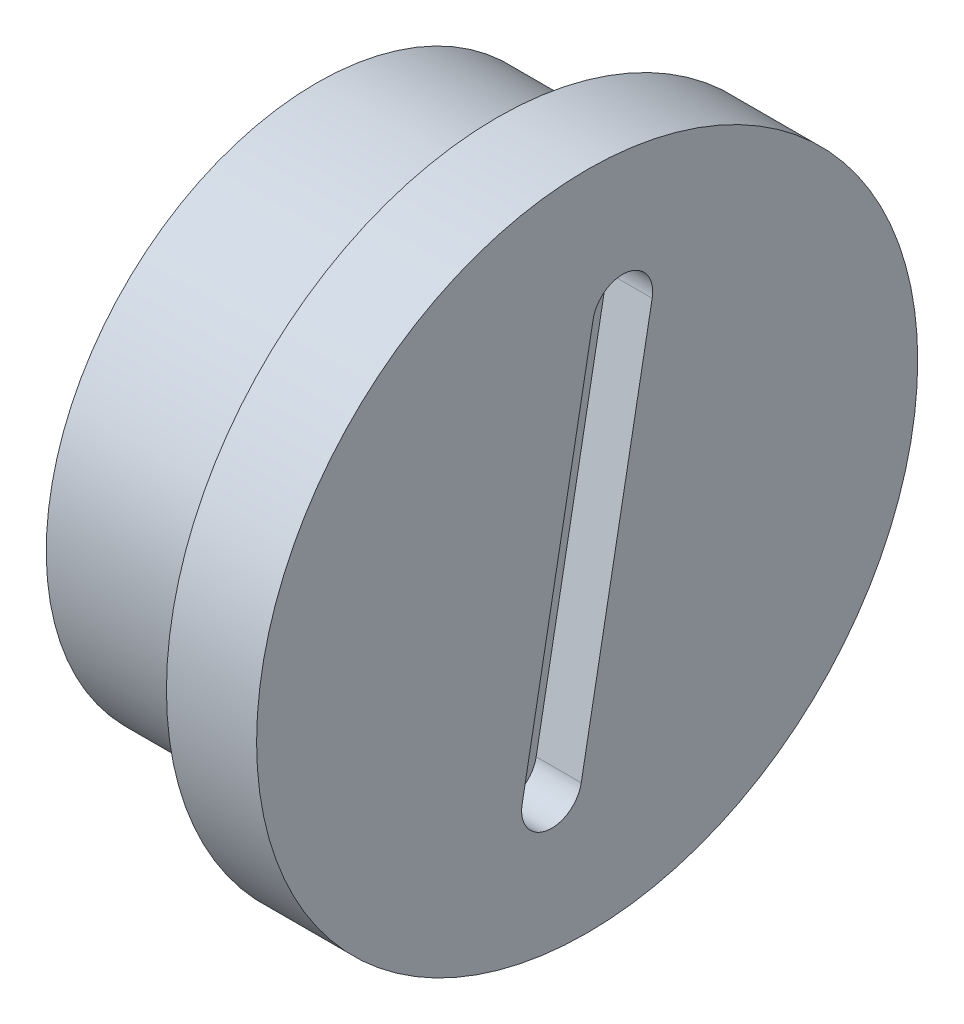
ISO-10303-21;
HEADER;
FILE_DESCRIPTION(('STEP AP214'),'2;1');
FILE_NAME('part.step','',(''),(''),'','','');
FILE_SCHEMA(('AUTOMOTIVE_DESIGN { 1 0 10303 214 1 1 1 1 }'));
ENDSEC;
DATA;
#1=APPLICATION_CONTEXT('core data for automotive mechanical design processes');
#2=APPLICATION_PROTOCOL_DEFINITION('international standard','automotive_design',2000,#1);
#3=PRODUCT_CONTEXT('',#1,'mechanical');
#4=PRODUCT('Part','Part','',(#3));
#5=PRODUCT_RELATED_PRODUCT_CATEGORY('part','',(#4));
#6=PRODUCT_DEFINITION_FORMATION('','',#4);
#7=PRODUCT_DEFINITION_CONTEXT('part definition',#1,'design');
#8=PRODUCT_DEFINITION('design','',#6,#7);
#9=PRODUCT_DEFINITION_SHAPE('','',#8);
#10=(LENGTH_UNIT() NAMED_UNIT(*) SI_UNIT(.MILLI.,.METRE.));
#11=(NAMED_UNIT(*) PLANE_ANGLE_UNIT() SI_UNIT($,.RADIAN.));
#12=(NAMED_UNIT(*) SI_UNIT($,.STERADIAN.) SOLID_ANGLE_UNIT());
#13=UNCERTAINTY_MEASURE_WITH_UNIT(LENGTH_MEASURE(1.E-05),#10,'distance_accuracy_value','');
#14=(GEOMETRIC_REPRESENTATION_CONTEXT(3) GLOBAL_UNCERTAINTY_ASSIGNED_CONTEXT((#13)) GLOBAL_UNIT_ASSIGNED_CONTEXT((#10,
#11,#12)) REPRESENTATION_CONTEXT('',''));
#15=CARTESIAN_POINT('',(0.,0.,0.));
#16=DIRECTION('',(0.,0.,1.));
#17=DIRECTION('',(1.,0.,0.));
#18=AXIS2_PLACEMENT_3D('',#15,#16,#17);
#19=CARTESIAN_POINT('',(31.5,84.,-76.5));
#20=DIRECTION('',(1.,0.,0.));
#21=DIRECTION('',(0.,1.,0.));
#22=AXIS2_PLACEMENT_3D('',#19,#20,#21);
#23=PLANE('',#22);
#24=CARTESIAN_POINT('',(31.5,84.,-76.5));
#25=DIRECTION('',(1.,0.,0.));
#26=DIRECTION('',(0.,1.,0.));
#27=AXIS2_PLACEMENT_3D('',#24,#25,#26);
#28=CIRCLE('',#27,9.);
#29=CARTESIAN_POINT('',(31.5,93.,-76.5));
#30=VERTEX_POINT('',#29);
#31=EDGE_CURVE('E20',#30,#30,#28,.T.);
#32=ORIENTED_EDGE('',*,*,#31,.F.);
#33=EDGE_LOOP('',(#32));
#34=FACE_BOUND('',#33,.T.);
#35=ADVANCED_FACE('F16',(#34),#23,.F.);
#36=CARTESIAN_POINT('',(31.5,84.,-76.5));
#37=DIRECTION('',(1.,0.,0.));
#38=DIRECTION('',(0.,1.,0.));
#39=AXIS2_PLACEMENT_3D('',#36,#37,#38);
#40=CYLINDRICAL_SURFACE('',#39,9.);
#41=CARTESIAN_POINT('',(37.5,84.,-76.5));
#42=DIRECTION('',(1.,0.,0.));
#43=DIRECTION('',(0.,1.,0.));
#44=AXIS2_PLACEMENT_3D('',#41,#42,#43);
#45=CIRCLE('',#44,9.);
#46=CARTESIAN_POINT('',(37.5,93.,-76.5));
#47=VERTEX_POINT('',#46);
#48=EDGE_CURVE('E76',#47,#47,#45,.F.);
#49=ORIENTED_EDGE('',*,*,#48,.T.);
#50=EDGE_LOOP('',(#49));
#51=FACE_BOUND('',#50,.T.);
#52=ORIENTED_EDGE('',*,*,#31,.T.);
#53=EDGE_LOOP('',(#52));
#54=FACE_BOUND('',#53,.T.);
#55=ADVANCED_FACE('F113',(#51,#54),#40,.T.);
#56=CARTESIAN_POINT('',(39.,90.3919397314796,-77.6802993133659));
#57=DIRECTION('',(-1.,0.,0.));
#58=DIRECTION('',(0.,-1.,0.));
#59=AXIS2_PLACEMENT_3D('',#56,#57,#58);
#60=PLANE('',#59);
#61=DIRECTION('',(0.,-0.983375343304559,0.181584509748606));
#62=VECTOR('',#61,1.);
#63=CARTESIAN_POINT('',(39.,77.789644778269,-74.3363253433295));
#64=LINE('',#63,#62);
#65=CARTESIAN_POINT('',(39.,90.5735242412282,-76.6969239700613));
#66=VERTEX_POINT('',#65);
#67=CARTESIAN_POINT('',(39.,77.7896447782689,-74.3363253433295));
#68=VERTEX_POINT('',#67);
#69=EDGE_CURVE('E92',#66,#68,#64,.T.);
#70=ORIENTED_EDGE('',*,*,#69,.T.);
#71=CARTESIAN_POINT('',(39.,77.6080602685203,-75.319700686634));
#72=DIRECTION('',(1.,0.,0.));
#73=DIRECTION('',(0.,1.,0.));
#74=AXIS2_PLACEMENT_3D('',#71,#72,#73);
#75=CIRCLE('',#74,1.);
#76=CARTESIAN_POINT('',(39.,77.4264757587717,-76.3030760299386));
#77=VERTEX_POINT('',#76);
#78=EDGE_CURVE('E62',#68,#77,#75,.T.);
#79=ORIENTED_EDGE('',*,*,#78,.T.);
#80=DIRECTION('',(0.,0.983375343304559,-0.181584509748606));
#81=VECTOR('',#80,1.);
#82=CARTESIAN_POINT('',(39.,90.210355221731,-78.6636746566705));
#83=LINE('',#82,#81);
#84=CARTESIAN_POINT('',(39.,90.210355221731,-78.6636746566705));
#85=VERTEX_POINT('',#84);
#86=EDGE_CURVE('E57',#77,#85,#83,.T.);
#87=ORIENTED_EDGE('',*,*,#86,.T.);
#88=CARTESIAN_POINT('',(39.,90.3919397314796,-77.6802993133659));
#89=DIRECTION('',(1.,0.,0.));
#90=DIRECTION('',(0.,1.,0.));
#91=AXIS2_PLACEMENT_3D('',#88,#89,#90);
#92=CIRCLE('',#91,1.);
#93=EDGE_CURVE('E60',#85,#66,#92,.T.);
#94=ORIENTED_EDGE('',*,*,#93,.T.);
#95=EDGE_LOOP('',(#70,#79,#87,#94));
#96=FACE_BOUND('',#95,.T.);
#97=ADVANCED_FACE('F59',(#96),#60,.F.);
#98=CARTESIAN_POINT('',(37.5,84.,-76.5));
#99=DIRECTION('',(1.,0.,0.));
#100=DIRECTION('',(0.,1.,0.));
#101=AXIS2_PLACEMENT_3D('',#98,#99,#100);
#102=PLANE('',#101);
#103=CARTESIAN_POINT('',(37.5,84.,-76.5));
#104=DIRECTION('',(-1.,0.,0.));
#105=DIRECTION('',(0.,-1.,0.));
#106=AXIS2_PLACEMENT_3D('',#103,#104,#105);
#107=CIRCLE('',#106,11.);
#108=CARTESIAN_POINT('',(37.5,73.,-76.5));
#109=VERTEX_POINT('',#108);
#110=EDGE_CURVE('E102',#109,#109,#107,.F.);
#111=ORIENTED_EDGE('',*,*,#110,.F.);
#112=EDGE_LOOP('',(#111));
#113=FACE_BOUND('',#112,.T.);
#114=ORIENTED_EDGE('',*,*,#48,.F.);
#115=EDGE_LOOP('',(#114));
#116=FACE_BOUND('',#115,.T.);
#117=ADVANCED_FACE('F152',(#113,#116),#102,.F.);
#118=CARTESIAN_POINT('',(39.,90.3919397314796,-77.6802993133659));
#119=DIRECTION('',(1.,0.,0.));
#120=DIRECTION('',(0.,1.,0.));
#121=AXIS2_PLACEMENT_3D('',#118,#119,#120);
#122=CYLINDRICAL_SURFACE('',#121,1.);
#123=DIRECTION('',(1.,0.,0.));
#124=VECTOR('',#123,1.);
#125=CARTESIAN_POINT('',(39.,90.210355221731,-78.6636746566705));
#126=LINE('',#125,#124);
#127=CARTESIAN_POINT('',(40.5,90.210355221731,-78.6636746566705));
#128=VERTEX_POINT('',#127);
#129=EDGE_CURVE('E67',#85,#128,#126,.T.);
#130=ORIENTED_EDGE('',*,*,#129,.T.);
#131=CARTESIAN_POINT('',(40.5,90.3919397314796,-77.6802993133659));
#132=DIRECTION('',(1.,0.,0.));
#133=DIRECTION('',(0.,1.,0.));
#134=AXIS2_PLACEMENT_3D('',#131,#132,#133);
#135=CIRCLE('',#134,1.);
#136=CARTESIAN_POINT('',(40.5,90.5735242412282,-76.6969239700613));
#137=VERTEX_POINT('',#136);
#138=EDGE_CURVE('E99',#137,#128,#135,.F.);
#139=ORIENTED_EDGE('',*,*,#138,.F.);
#140=DIRECTION('',(1.,0.,0.));
#141=VECTOR('',#140,1.);
#142=CARTESIAN_POINT('',(39.,90.5735242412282,-76.6969239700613));
#143=LINE('',#142,#141);
#144=EDGE_CURVE('E73',#137,#66,#143,.F.);
#145=ORIENTED_EDGE('',*,*,#144,.T.);
#146=ORIENTED_EDGE('',*,*,#93,.F.);
#147=EDGE_LOOP('',(#130,#139,#145,#146));
#148=FACE_BOUND('',#147,.T.);
#149=ADVANCED_FACE('F70',(#148),#122,.F.);
#150=CARTESIAN_POINT('',(39.,90.210355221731,-78.6636746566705));
#151=DIRECTION('',(0.,-0.181584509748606,-0.983375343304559));
#152=DIRECTION('',(0.,0.983375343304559,-0.181584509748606));
#153=AXIS2_PLACEMENT_3D('',#150,#151,#152);
#154=PLANE('',#153);
#155=ORIENTED_EDGE('',*,*,#129,.F.);
#156=ORIENTED_EDGE('',*,*,#86,.F.);
#157=DIRECTION('',(1.,0.,0.));
#158=VECTOR('',#157,1.);
#159=CARTESIAN_POINT('',(39.,77.4264757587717,-76.3030760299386));
#160=LINE('',#159,#158);
#161=CARTESIAN_POINT('',(40.5,77.4264757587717,-76.3030760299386));
#162=VERTEX_POINT('',#161);
#163=EDGE_CURVE('E87',#77,#162,#160,.T.);
#164=ORIENTED_EDGE('',*,*,#163,.T.);
#165=DIRECTION('',(0.,-0.983375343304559,0.181584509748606));
#166=VECTOR('',#165,1.);
#167=CARTESIAN_POINT('',(40.5,90.210355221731,-78.6636746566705));
#168=LINE('',#167,#166);
#169=EDGE_CURVE('E80',#128,#162,#168,.T.);
#170=ORIENTED_EDGE('',*,*,#169,.F.);
#171=EDGE_LOOP('',(#155,#156,#164,#170));
#172=FACE_BOUND('',#171,.T.);
#173=ADVANCED_FACE('F78',(#172),#154,.F.);
#174=CARTESIAN_POINT('',(39.,77.6080602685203,-75.319700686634));
#175=DIRECTION('',(1.,0.,0.));
#176=DIRECTION('',(0.,1.,0.));
#177=AXIS2_PLACEMENT_3D('',#174,#175,#176);
#178=CYLINDRICAL_SURFACE('',#177,1.);
#179=ORIENTED_EDGE('',*,*,#163,.F.);
#180=ORIENTED_EDGE('',*,*,#78,.F.);
#181=DIRECTION('',(1.,0.,0.));
#182=VECTOR('',#181,1.);
#183=CARTESIAN_POINT('',(39.,77.789644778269,-74.3363253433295));
#184=LINE('',#183,#182);
#185=CARTESIAN_POINT('',(40.5,77.7896447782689,-74.3363253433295));
#186=VERTEX_POINT('',#185);
#187=EDGE_CURVE('E36',#68,#186,#184,.T.);
#188=ORIENTED_EDGE('',*,*,#187,.T.);
#189=CARTESIAN_POINT('',(40.5,77.6080602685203,-75.319700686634));
#190=DIRECTION('',(1.,0.,0.));
#191=DIRECTION('',(0.,1.,0.));
#192=AXIS2_PLACEMENT_3D('',#189,#190,#191);
#193=CIRCLE('',#192,1.);
#194=EDGE_CURVE('E95',#162,#186,#193,.F.);
#195=ORIENTED_EDGE('',*,*,#194,.F.);
#196=EDGE_LOOP('',(#179,#180,#188,#195));
#197=FACE_BOUND('',#196,.T.);
#198=ADVANCED_FACE('F131',(#197),#178,.F.);
#199=CARTESIAN_POINT('',(39.,77.789644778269,-74.3363253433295));
#200=DIRECTION('',(0.,0.181584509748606,0.983375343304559));
#201=DIRECTION('',(0.,-0.983375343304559,0.181584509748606));
#202=AXIS2_PLACEMENT_3D('',#199,#200,#201);
#203=PLANE('',#202);
#204=ORIENTED_EDGE('',*,*,#187,.F.);
#205=ORIENTED_EDGE('',*,*,#69,.F.);
#206=ORIENTED_EDGE('',*,*,#144,.F.);
#207=DIRECTION('',(0.,0.983375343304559,-0.181584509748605));
#208=VECTOR('',#207,1.);
#209=CARTESIAN_POINT('',(40.5,77.789644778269,-74.3363253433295));
#210=LINE('',#209,#208);
#211=EDGE_CURVE('E27',#186,#137,#210,.T.);
#212=ORIENTED_EDGE('',*,*,#211,.F.);
#213=EDGE_LOOP('',(#204,#205,#206,#212));
#214=FACE_BOUND('',#213,.T.);
#215=ADVANCED_FACE('F126',(#214),#203,.F.);
#216=CARTESIAN_POINT('',(40.5,84.,-76.5));
#217=DIRECTION('',(-1.,0.,0.));
#218=DIRECTION('',(0.,-1.,0.));
#219=AXIS2_PLACEMENT_3D('',#216,#217,#218);
#220=CYLINDRICAL_SURFACE('',#219,11.);
#221=ORIENTED_EDGE('',*,*,#110,.T.);
#222=EDGE_LOOP('',(#221));
#223=FACE_BOUND('',#222,.T.);
#224=CARTESIAN_POINT('',(40.5,84.,-76.5));
#225=DIRECTION('',(-1.,0.,0.));
#226=DIRECTION('',(0.,-1.,0.));
#227=AXIS2_PLACEMENT_3D('',#224,#225,#226);
#228=CIRCLE('',#227,11.);
#229=CARTESIAN_POINT('',(40.5,73.,-76.5));
#230=VERTEX_POINT('',#229);
#231=EDGE_CURVE('E11',#230,#230,#228,.F.);
#232=ORIENTED_EDGE('',*,*,#231,.F.);
#233=EDGE_LOOP('',(#232));
#234=FACE_BOUND('',#233,.T.);
#235=ADVANCED_FACE('F122',(#223,#234),#220,.T.);
#236=CARTESIAN_POINT('',(40.5,84.,-76.5));
#237=DIRECTION('',(1.,0.,0.));
#238=DIRECTION('',(0.,1.,0.));
#239=AXIS2_PLACEMENT_3D('',#236,#237,#238);
#240=PLANE('',#239);
#241=ORIENTED_EDGE('',*,*,#231,.T.);
#242=EDGE_LOOP('',(#241));
#243=FACE_BOUND('',#242,.T.);
#244=ORIENTED_EDGE('',*,*,#194,.T.);
#245=ORIENTED_EDGE('',*,*,#211,.T.);
#246=ORIENTED_EDGE('',*,*,#138,.T.);
#247=ORIENTED_EDGE('',*,*,#169,.T.);
#248=EDGE_LOOP('',(#244,#245,#246,#247));
#249=FACE_BOUND('',#248,.T.);
#250=ADVANCED_FACE('F18',(#243,#249),#240,.T.);
#251=CLOSED_SHELL('',(#35,#55,#97,#117,#149,#173,#198,#215,#235,#250));
#252=MANIFOLD_SOLID_BREP('B1',#251);
#253=ADVANCED_BREP_SHAPE_REPRESENTATION('',(#18,#252),#14);
#254=SHAPE_DEFINITION_REPRESENTATION(#9,#253);
ENDSEC;
END-ISO-10303-21;
